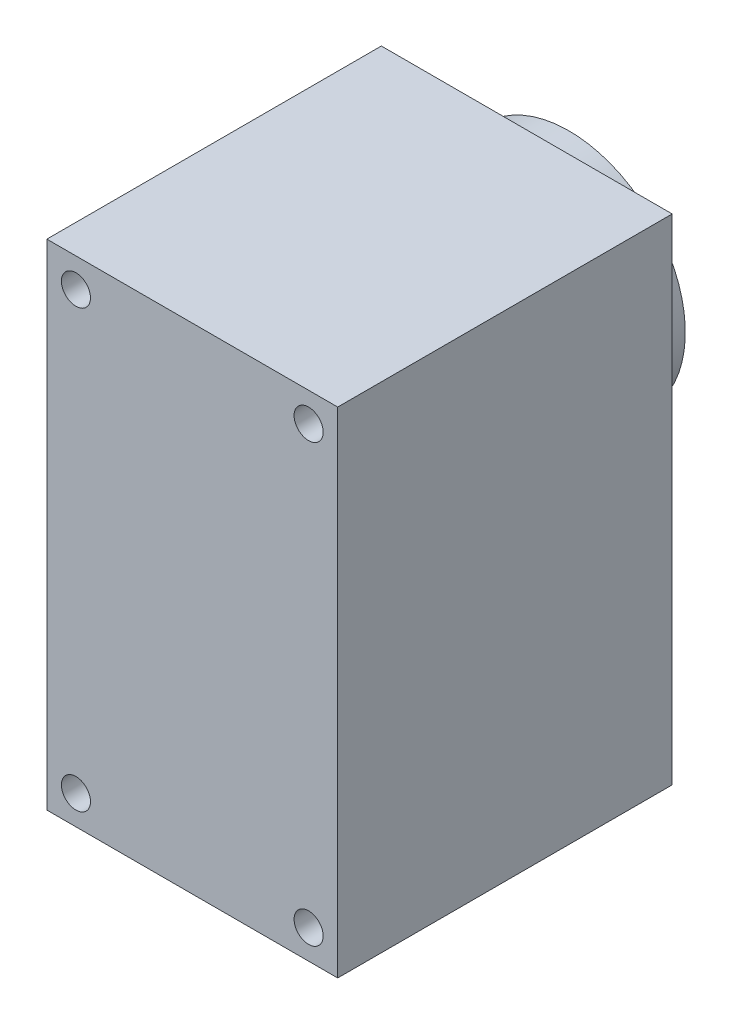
from build123d import *

# Parameters (mm, degrees)
SKETCH1_W           = 20
SKETCH1_H           = 34
SKETCH1_R           = 1
BOSS_EXTRUDE1_DEPTH = 23
SKETCH2_R           = 8
SKETCH2_R_2         = 1
BOSS_EXTRUDE2_DEPTH = 2.9


with BuildPart() as part:
    # Sketch1 → Boss-Extrude1 (new body)
    with BuildSketch(Plane.XY):
        with Locations((6.406569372, -2.731740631)):
            Rectangle(SKETCH1_W, SKETCH1_H)
        with Locations((-1.593430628, 12.268259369)):
            Circle(SKETCH1_R, mode=Mode.SUBTRACT)
        with Locations(Location((14.406569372, 12.268259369, 0), (0, 0, 180))):
            Circle(SKETCH1_R, mode=Mode.SUBTRACT)
        with Locations(Location((-1.593430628, -17.731740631, 0), (0, 0, 180))):
            Circle(SKETCH1_R, mode=Mode.SUBTRACT)
        with Locations((14.406569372, -17.731740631)):
            Circle(SKETCH1_R, mode=Mode.SUBTRACT)
    extrude(amount=BOSS_EXTRUDE1_DEPTH)

    # Sketch2 → Boss-Extrude2 (add)
    with BuildSketch(Plane(origin=(0, 0, 0), x_dir=(-1, 0, 0), z_dir=(0, 0, -1))):
        with Locations((-6.406569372, 4.768259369)):
            Circle(SKETCH2_R)
        with Locations((-6.406569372, 10.768259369)):
            Circle(SKETCH2_R_2, mode=Mode.SUBTRACT)
        with Locations((-12.406569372, 4.768259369)):
            Circle(SKETCH2_R_2, mode=Mode.SUBTRACT)
        with Locations(Location((-6.406569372, -1.231740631, 0), (0, 0, 180))):
            Circle(SKETCH2_R_2, mode=Mode.SUBTRACT)
        with Locations(Location((-0.406569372, 4.768259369, 0), (0, 0, 180))):
            Circle(SKETCH2_R_2, mode=Mode.SUBTRACT)
        with Locations((-6.406569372, 4.768259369)):
            Circle(SKETCH2_R_2, mode=Mode.SUBTRACT)
    extrude(amount=BOSS_EXTRUDE2_DEPTH)


solid = part.part
